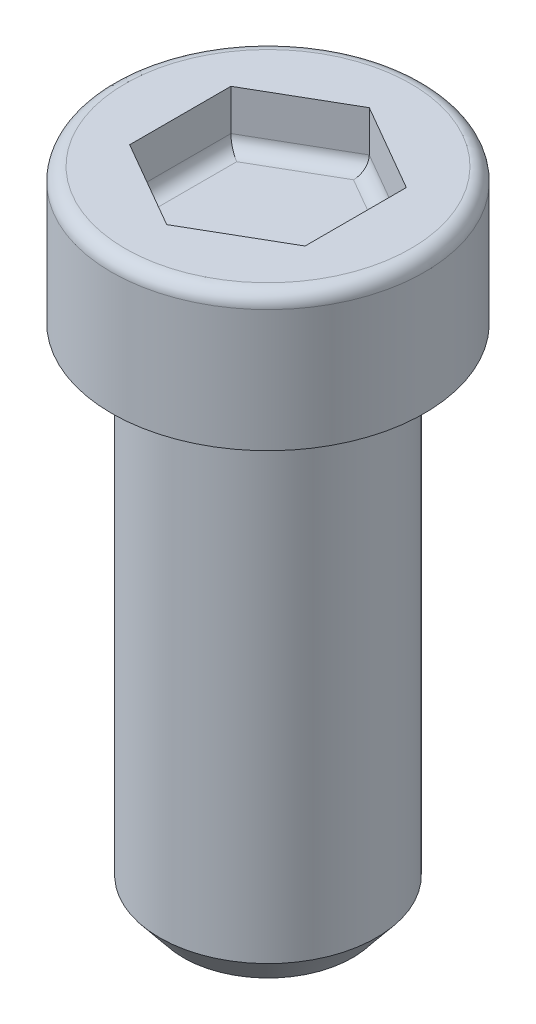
from build123d import *

# Parameters (mm, degrees)
ENL_V_MAT_EXTRU_1_DEPTH = 2
CONG_1_R                = 0.5


with BuildPart() as part:
    # Esquisse1 → R_volution1 (revolve)
    with BuildSketch(Plane(origin=(-222.928713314, 0, 0), x_dir=(0, 0, -1), z_dir=(1, 0, 0)), mode=Mode.PRIVATE) as r_volution1_sk:
        with BuildLine():
            Line((-50, -43.710688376), (-46.904592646, -43.710688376))
            Line((-46.904592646, -43.710688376), (-46.025473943, -42.631388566))
            Line((-46.025473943, -42.631388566), (-46.025473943, -25.110839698))
            Line((-46.025473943, -25.110839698), (-44.266122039, -25.110839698))
            Line((-44.266122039, -25.110839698), (-44.266122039, -20.633627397))
            ThreePointArc((-44.266122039, -20.633627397), (-44.412568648, -20.280074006), (-44.766122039, -20.133627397))
            Line((-44.766122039, -20.133627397), (-50, -20.133627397))
            Line((-50, -20.133627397), (-50, -25.110839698))
            Line((-50, -25.110839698), (-50, -43.710688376))
        make_face()
    revolve(r_volution1_sk.sketch.rotate(Axis((-222.928713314, -25.110839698, 50), (0, -1, 0)), 180), axis=Axis((-222.928713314, -25.110839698, 50), (0, -1, 0)))

    # Esquisse2 → Enl_v. mat.-Extru.1 (cut)
    with BuildSketch(Plane(origin=(0, -20.133627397, 0), x_dir=(1, 0, 0), z_dir=(0, 1, 0))):
        Polygon((-222.928713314, -46.289054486), (-226.142486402, -48.144527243), (-226.142486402, -51.855472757), (-222.928713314, -53.710945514), (-219.714940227, -51.855472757), (-219.714940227, -48.144527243), align=None)
    extrude(amount=-ENL_V_MAT_EXTRU_1_DEPTH, mode=Mode.SUBTRACT)

    # Cong_1
    cong_1_edges = [part.edges().sort_by_distance(p)[0] for p in [
        (-221.32182677, -22.133627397, 47.216790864),
        (-219.714940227, -22.133627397, 50),
        (-221.32182677, -22.133627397, 52.783209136),
        (-224.535599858, -22.133627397, 52.783209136),
        (-226.142486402, -22.133627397, 50),
        (-224.535599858, -22.133627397, 47.216790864),
    ]]
    fillet(cong_1_edges, radius=CONG_1_R)


solid = part.part
